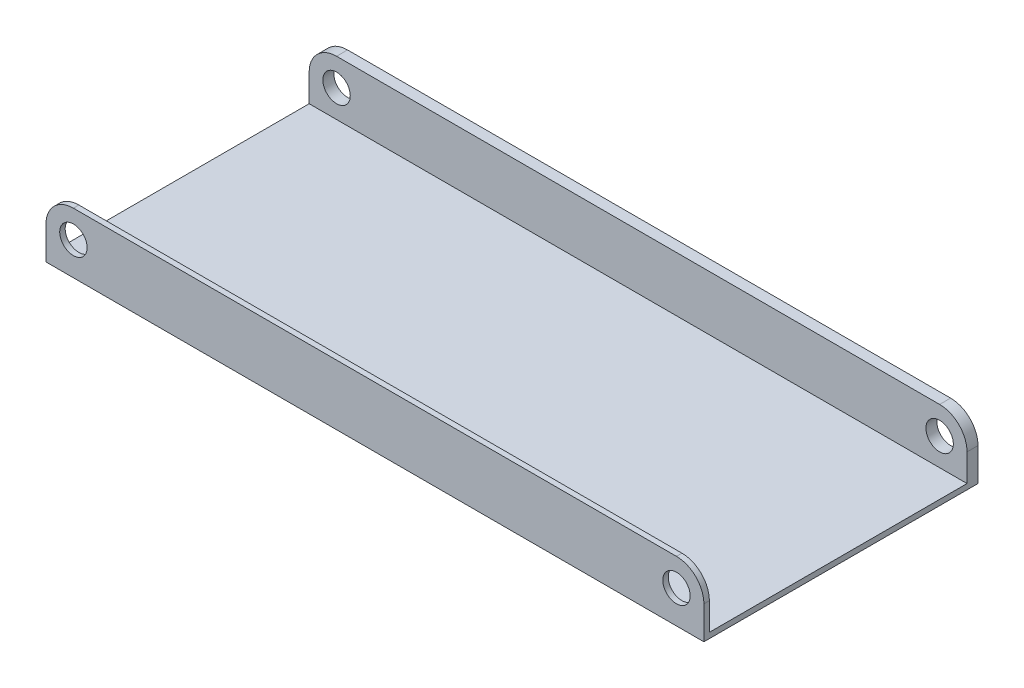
ISO-10303-21;
HEADER;
FILE_DESCRIPTION(('STEP AP214'),'2;1');
FILE_NAME('part.step','',(''),(''),'','','');
FILE_SCHEMA(('AUTOMOTIVE_DESIGN { 1 0 10303 214 1 1 1 1 }'));
ENDSEC;
DATA;
#1=APPLICATION_CONTEXT('core data for automotive mechanical design processes');
#2=APPLICATION_PROTOCOL_DEFINITION('international standard','automotive_design',2000,#1);
#3=PRODUCT_CONTEXT('',#1,'mechanical');
#4=PRODUCT('Part','Part','',(#3));
#5=PRODUCT_RELATED_PRODUCT_CATEGORY('part','',(#4));
#6=PRODUCT_DEFINITION_FORMATION('','',#4);
#7=PRODUCT_DEFINITION_CONTEXT('part definition',#1,'design');
#8=PRODUCT_DEFINITION('design','',#6,#7);
#9=PRODUCT_DEFINITION_SHAPE('','',#8);
#10=(LENGTH_UNIT() NAMED_UNIT(*) SI_UNIT(.MILLI.,.METRE.));
#11=(NAMED_UNIT(*) PLANE_ANGLE_UNIT() SI_UNIT($,.RADIAN.));
#12=(NAMED_UNIT(*) SI_UNIT($,.STERADIAN.) SOLID_ANGLE_UNIT());
#13=UNCERTAINTY_MEASURE_WITH_UNIT(LENGTH_MEASURE(1.E-05),#10,'distance_accuracy_value','');
#14=(GEOMETRIC_REPRESENTATION_CONTEXT(3) GLOBAL_UNCERTAINTY_ASSIGNED_CONTEXT((#13)) GLOBAL_UNIT_ASSIGNED_CONTEXT((#10,
#11,#12)) REPRESENTATION_CONTEXT('',''));
#15=CARTESIAN_POINT('',(0.,0.,0.));
#16=DIRECTION('',(0.,0.,1.));
#17=DIRECTION('',(1.,0.,0.));
#18=AXIS2_PLACEMENT_3D('',#15,#16,#17);
#19=CARTESIAN_POINT('',(0.,1.27,0.));
#20=DIRECTION('',(0.,1.,0.));
#21=DIRECTION('',(0.,0.,1.));
#22=AXIS2_PLACEMENT_3D('',#19,#20,#21);
#23=PLANE('',#22);
#24=DIRECTION('',(0.,0.,-1.));
#25=VECTOR('',#24,1.);
#26=CARTESIAN_POINT('',(152.4,1.27,0.));
#27=LINE('',#26,#25);
#28=CARTESIAN_POINT('',(152.4,1.27,62.23));
#29=VERTEX_POINT('',#28);
#30=CARTESIAN_POINT('',(152.4,1.27,2.53999999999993));
#31=VERTEX_POINT('',#30);
#32=EDGE_CURVE('E139',#29,#31,#27,.T.);
#33=ORIENTED_EDGE('',*,*,#32,.T.);
#34=DIRECTION('',(1.,0.,0.));
#35=VECTOR('',#34,1.);
#36=CARTESIAN_POINT('',(0.,1.27,2.53999999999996));
#37=LINE('',#36,#35);
#38=CARTESIAN_POINT('',(0.,1.27,2.53999999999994));
#39=VERTEX_POINT('',#38);
#40=EDGE_CURVE('E138',#39,#31,#37,.T.);
#41=ORIENTED_EDGE('',*,*,#40,.F.);
#42=DIRECTION('',(0.,0.,1.));
#43=VECTOR('',#42,1.);
#44=CARTESIAN_POINT('',(0.,1.27,0.));
#45=LINE('',#44,#43);
#46=CARTESIAN_POINT('',(0.,1.27,62.23));
#47=VERTEX_POINT('',#46);
#48=EDGE_CURVE('E122',#39,#47,#45,.T.);
#49=ORIENTED_EDGE('',*,*,#48,.T.);
#50=DIRECTION('',(-1.,0.,0.));
#51=VECTOR('',#50,1.);
#52=CARTESIAN_POINT('',(0.,1.27,62.23));
#53=LINE('',#52,#51);
#54=EDGE_CURVE('E135',#29,#47,#53,.T.);
#55=ORIENTED_EDGE('',*,*,#54,.F.);
#56=EDGE_LOOP('',(#33,#41,#49,#55));
#57=FACE_BOUND('',#56,.T.);
#58=ADVANCED_FACE('F33',(#57),#23,.T.);
#59=CARTESIAN_POINT('',(0.,1.27,0.));
#60=DIRECTION('',(1.,0.,0.));
#61=DIRECTION('',(0.,0.,-1.));
#62=AXIS2_PLACEMENT_3D('',#59,#60,#61);
#63=PLANE('',#62);
#64=DIRECTION('',(0.,-1.,0.));
#65=VECTOR('',#64,1.);
#66=CARTESIAN_POINT('',(0.,13.97,2.53999999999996));
#67=LINE('',#66,#65);
#68=CARTESIAN_POINT('',(0.,7.62,2.53999999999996));
#69=VERTEX_POINT('',#68);
#70=EDGE_CURVE('E146',#69,#39,#67,.T.);
#71=ORIENTED_EDGE('',*,*,#70,.F.);
#72=DIRECTION('',(0.,0.,1.));
#73=VECTOR('',#72,1.);
#74=CARTESIAN_POINT('',(0.,7.62,0.));
#75=LINE('',#74,#73);
#76=CARTESIAN_POINT('',(0.,7.62,0.));
#77=VERTEX_POINT('',#76);
#78=EDGE_CURVE('E11',#69,#77,#75,.F.);
#79=ORIENTED_EDGE('',*,*,#78,.T.);
#80=DIRECTION('',(0.,-1.,0.));
#81=VECTOR('',#80,1.);
#82=CARTESIAN_POINT('',(0.,1.27,0.));
#83=LINE('',#82,#81);
#84=CARTESIAN_POINT('',(0.,0.,0.));
#85=VERTEX_POINT('',#84);
#86=EDGE_CURVE('E157',#77,#85,#83,.T.);
#87=ORIENTED_EDGE('',*,*,#86,.T.);
#88=DIRECTION('',(0.,0.,1.));
#89=VECTOR('',#88,1.);
#90=CARTESIAN_POINT('',(0.,0.,0.));
#91=LINE('',#90,#89);
#92=CARTESIAN_POINT('',(0.,0.,63.5));
#93=VERTEX_POINT('',#92);
#94=EDGE_CURVE('E154',#85,#93,#91,.T.);
#95=ORIENTED_EDGE('',*,*,#94,.T.);
#96=DIRECTION('',(0.,-1.,0.));
#97=VECTOR('',#96,1.);
#98=CARTESIAN_POINT('',(0.,1.27,63.5));
#99=LINE('',#98,#97);
#100=CARTESIAN_POINT('',(0.,7.62,63.5));
#101=VERTEX_POINT('',#100);
#102=EDGE_CURVE('E173',#101,#93,#99,.T.);
#103=ORIENTED_EDGE('',*,*,#102,.F.);
#104=DIRECTION('',(0.,0.,1.));
#105=VECTOR('',#104,1.);
#106=CARTESIAN_POINT('',(0.,7.62,0.));
#107=LINE('',#106,#105);
#108=CARTESIAN_POINT('',(0.,7.62,62.23));
#109=VERTEX_POINT('',#108);
#110=EDGE_CURVE('E41',#101,#109,#107,.F.);
#111=ORIENTED_EDGE('',*,*,#110,.T.);
#112=DIRECTION('',(0.,-1.,0.));
#113=VECTOR('',#112,1.);
#114=CARTESIAN_POINT('',(0.,13.97,62.23));
#115=LINE('',#114,#113);
#116=EDGE_CURVE('E119',#109,#47,#115,.T.);
#117=ORIENTED_EDGE('',*,*,#116,.T.);
#118=ORIENTED_EDGE('',*,*,#48,.F.);
#119=EDGE_LOOP('',(#71,#79,#87,#95,#103,#111,#117,#118));
#120=FACE_BOUND('',#119,.T.);
#121=ADVANCED_FACE('F121',(#120),#63,.F.);
#122=CARTESIAN_POINT('',(0.,1.27,63.5));
#123=DIRECTION('',(0.,0.,-1.));
#124=DIRECTION('',(-1.,0.,0.));
#125=AXIS2_PLACEMENT_3D('',#122,#123,#124);
#126=PLANE('',#125);
#127=CARTESIAN_POINT('',(6.35,7.62,63.5));
#128=DIRECTION('',(0.,0.,1.));
#129=DIRECTION('',(1.,0.,0.));
#130=AXIS2_PLACEMENT_3D('',#127,#128,#129);
#131=CIRCLE('',#130,3.175);
#132=CARTESIAN_POINT('',(9.525,7.62,63.5));
#133=VERTEX_POINT('',#132);
#134=EDGE_CURVE('E306',#133,#133,#131,.T.);
#135=ORIENTED_EDGE('',*,*,#134,.F.);
#136=EDGE_LOOP('',(#135));
#137=FACE_BOUND('',#136,.T.);
#138=CARTESIAN_POINT('',(146.05,7.62,63.5));
#139=DIRECTION('',(0.,0.,1.));
#140=DIRECTION('',(1.,0.,0.));
#141=AXIS2_PLACEMENT_3D('',#138,#139,#140);
#142=CIRCLE('',#141,3.175);
#143=CARTESIAN_POINT('',(149.225,7.62,63.5));
#144=VERTEX_POINT('',#143);
#145=EDGE_CURVE('E300',#144,#144,#142,.T.);
#146=ORIENTED_EDGE('',*,*,#145,.F.);
#147=EDGE_LOOP('',(#146));
#148=FACE_BOUND('',#147,.T.);
#149=DIRECTION('',(0.,-1.,0.));
#150=VECTOR('',#149,1.);
#151=CARTESIAN_POINT('',(152.4,1.27,63.5));
#152=LINE('',#151,#150);
#153=CARTESIAN_POINT('',(152.4,7.62,63.5));
#154=VERTEX_POINT('',#153);
#155=CARTESIAN_POINT('',(152.4,0.,63.5));
#156=VERTEX_POINT('',#155);
#157=EDGE_CURVE('E171',#154,#156,#152,.T.);
#158=ORIENTED_EDGE('',*,*,#157,.F.);
#159=CARTESIAN_POINT('',(146.05,7.62,63.5));
#160=DIRECTION('',(0.,0.,-1.));
#161=DIRECTION('',(-1.,0.,0.));
#162=AXIS2_PLACEMENT_3D('',#159,#160,#161);
#163=CIRCLE('',#162,6.35);
#164=CARTESIAN_POINT('',(146.05,13.97,63.5));
#165=VERTEX_POINT('',#164);
#166=EDGE_CURVE('E200',#154,#165,#163,.F.);
#167=ORIENTED_EDGE('',*,*,#166,.T.);
#168=DIRECTION('',(1.,0.,0.));
#169=VECTOR('',#168,1.);
#170=CARTESIAN_POINT('',(0.,13.97,63.5));
#171=LINE('',#170,#169);
#172=CARTESIAN_POINT('',(6.35000000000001,13.97,63.5));
#173=VERTEX_POINT('',#172);
#174=EDGE_CURVE('E145',#173,#165,#171,.T.);
#175=ORIENTED_EDGE('',*,*,#174,.F.);
#176=CARTESIAN_POINT('',(6.35000000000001,7.62,63.5));
#177=DIRECTION('',(0.,0.,-1.));
#178=DIRECTION('',(-1.,0.,0.));
#179=AXIS2_PLACEMENT_3D('',#176,#177,#178);
#180=CIRCLE('',#179,6.35);
#181=EDGE_CURVE('E198',#173,#101,#180,.F.);
#182=ORIENTED_EDGE('',*,*,#181,.T.);
#183=ORIENTED_EDGE('',*,*,#102,.T.);
#184=DIRECTION('',(1.,0.,0.));
#185=VECTOR('',#184,1.);
#186=CARTESIAN_POINT('',(0.,0.,63.5));
#187=LINE('',#186,#185);
#188=EDGE_CURVE('E160',#93,#156,#187,.T.);
#189=ORIENTED_EDGE('',*,*,#188,.T.);
#190=EDGE_LOOP('',(#158,#167,#175,#182,#183,#189));
#191=FACE_BOUND('',#190,.T.);
#192=ADVANCED_FACE('F258',(#137,#148,#191),#126,.F.);
#193=CARTESIAN_POINT('',(152.4,1.27,0.));
#194=DIRECTION('',(-1.,0.,0.));
#195=DIRECTION('',(0.,0.,1.));
#196=AXIS2_PLACEMENT_3D('',#193,#194,#195);
#197=PLANE('',#196);
#198=DIRECTION('',(0.,-1.,0.));
#199=VECTOR('',#198,1.);
#200=CARTESIAN_POINT('',(152.4,13.97,62.23));
#201=LINE('',#200,#199);
#202=CARTESIAN_POINT('',(152.4,7.62,62.23));
#203=VERTEX_POINT('',#202);
#204=EDGE_CURVE('E128',#203,#29,#201,.T.);
#205=ORIENTED_EDGE('',*,*,#204,.F.);
#206=DIRECTION('',(0.,0.,-1.));
#207=VECTOR('',#206,1.);
#208=CARTESIAN_POINT('',(152.4,7.62,0.));
#209=LINE('',#208,#207);
#210=EDGE_CURVE('E196',#203,#154,#209,.F.);
#211=ORIENTED_EDGE('',*,*,#210,.T.);
#212=ORIENTED_EDGE('',*,*,#157,.T.);
#213=DIRECTION('',(0.,0.,-1.));
#214=VECTOR('',#213,1.);
#215=CARTESIAN_POINT('',(152.4,0.,0.));
#216=LINE('',#215,#214);
#217=CARTESIAN_POINT('',(152.4,0.,0.));
#218=VERTEX_POINT('',#217);
#219=EDGE_CURVE('E163',#156,#218,#216,.T.);
#220=ORIENTED_EDGE('',*,*,#219,.T.);
#221=DIRECTION('',(0.,-1.,0.));
#222=VECTOR('',#221,1.);
#223=CARTESIAN_POINT('',(152.4,1.27,0.));
#224=LINE('',#223,#222);
#225=CARTESIAN_POINT('',(152.4,7.62,0.));
#226=VERTEX_POINT('',#225);
#227=EDGE_CURVE('E169',#226,#218,#224,.T.);
#228=ORIENTED_EDGE('',*,*,#227,.F.);
#229=DIRECTION('',(0.,0.,-1.));
#230=VECTOR('',#229,1.);
#231=CARTESIAN_POINT('',(152.4,7.62,2.53999999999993));
#232=LINE('',#231,#230);
#233=CARTESIAN_POINT('',(152.4,7.62,2.53999999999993));
#234=VERTEX_POINT('',#233);
#235=EDGE_CURVE('E194',#226,#234,#232,.F.);
#236=ORIENTED_EDGE('',*,*,#235,.T.);
#237=DIRECTION('',(0.,-1.,0.));
#238=VECTOR('',#237,1.);
#239=CARTESIAN_POINT('',(152.4,13.97,2.53999999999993));
#240=LINE('',#239,#238);
#241=EDGE_CURVE('E150',#234,#31,#240,.T.);
#242=ORIENTED_EDGE('',*,*,#241,.T.);
#243=ORIENTED_EDGE('',*,*,#32,.F.);
#244=EDGE_LOOP('',(#205,#211,#212,#220,#228,#236,#242,#243));
#245=FACE_BOUND('',#244,.T.);
#246=ADVANCED_FACE('F234',(#245),#197,.F.);
#247=CARTESIAN_POINT('',(0.,1.27,0.));
#248=DIRECTION('',(0.,0.,1.));
#249=DIRECTION('',(1.,0.,0.));
#250=AXIS2_PLACEMENT_3D('',#247,#248,#249);
#251=PLANE('',#250);
#252=CARTESIAN_POINT('',(6.35,7.62,0.));
#253=DIRECTION('',(0.,0.,1.));
#254=DIRECTION('',(1.,0.,0.));
#255=AXIS2_PLACEMENT_3D('',#252,#253,#254);
#256=CIRCLE('',#255,3.175);
#257=CARTESIAN_POINT('',(9.525,7.62,0.));
#258=VERTEX_POINT('',#257);
#259=EDGE_CURVE('E180',#258,#258,#256,.T.);
#260=ORIENTED_EDGE('',*,*,#259,.T.);
#261=EDGE_LOOP('',(#260));
#262=FACE_BOUND('',#261,.T.);
#263=CARTESIAN_POINT('',(146.05,7.62,0.));
#264=DIRECTION('',(0.,0.,1.));
#265=DIRECTION('',(1.,0.,0.));
#266=AXIS2_PLACEMENT_3D('',#263,#264,#265);
#267=CIRCLE('',#266,3.175);
#268=CARTESIAN_POINT('',(149.225,7.62,0.));
#269=VERTEX_POINT('',#268);
#270=EDGE_CURVE('E303',#269,#269,#267,.T.);
#271=ORIENTED_EDGE('',*,*,#270,.T.);
#272=EDGE_LOOP('',(#271));
#273=FACE_BOUND('',#272,.T.);
#274=DIRECTION('',(-1.,0.,0.));
#275=VECTOR('',#274,1.);
#276=CARTESIAN_POINT('',(0.,13.97,0.));
#277=LINE('',#276,#275);
#278=CARTESIAN_POINT('',(146.05,13.97,0.));
#279=VERTEX_POINT('',#278);
#280=CARTESIAN_POINT('',(6.35,13.97,0.));
#281=VERTEX_POINT('',#280);
#282=EDGE_CURVE('E227',#279,#281,#277,.T.);
#283=ORIENTED_EDGE('',*,*,#282,.F.);
#284=CARTESIAN_POINT('',(146.05,7.62,0.));
#285=DIRECTION('',(0.,0.,1.));
#286=DIRECTION('',(1.,0.,0.));
#287=AXIS2_PLACEMENT_3D('',#284,#285,#286);
#288=CIRCLE('',#287,6.35);
#289=EDGE_CURVE('E210',#279,#226,#288,.F.);
#290=ORIENTED_EDGE('',*,*,#289,.T.);
#291=ORIENTED_EDGE('',*,*,#227,.T.);
#292=DIRECTION('',(-1.,0.,0.));
#293=VECTOR('',#292,1.);
#294=CARTESIAN_POINT('',(0.,0.,0.));
#295=LINE('',#294,#293);
#296=EDGE_CURVE('E140',#218,#85,#295,.T.);
#297=ORIENTED_EDGE('',*,*,#296,.T.);
#298=ORIENTED_EDGE('',*,*,#86,.F.);
#299=CARTESIAN_POINT('',(6.35,7.62,0.));
#300=DIRECTION('',(0.,0.,1.));
#301=DIRECTION('',(1.,0.,0.));
#302=AXIS2_PLACEMENT_3D('',#299,#300,#301);
#303=CIRCLE('',#302,6.35);
#304=EDGE_CURVE('E208',#77,#281,#303,.F.);
#305=ORIENTED_EDGE('',*,*,#304,.T.);
#306=EDGE_LOOP('',(#283,#290,#291,#297,#298,#305));
#307=FACE_BOUND('',#306,.T.);
#308=ADVANCED_FACE('F232',(#262,#273,#307),#251,.F.);
#309=CARTESIAN_POINT('',(0.,0.,0.));
#310=DIRECTION('',(0.,1.,0.));
#311=DIRECTION('',(0.,0.,1.));
#312=AXIS2_PLACEMENT_3D('',#309,#310,#311);
#313=PLANE('',#312);
#314=ORIENTED_EDGE('',*,*,#94,.F.);
#315=ORIENTED_EDGE('',*,*,#296,.F.);
#316=ORIENTED_EDGE('',*,*,#219,.F.);
#317=ORIENTED_EDGE('',*,*,#188,.F.);
#318=EDGE_LOOP('',(#314,#315,#316,#317));
#319=FACE_BOUND('',#318,.T.);
#320=ADVANCED_FACE('F241',(#319),#313,.F.);
#321=CARTESIAN_POINT('',(0.,13.97,62.23));
#322=DIRECTION('',(0.,0.,1.));
#323=DIRECTION('',(1.,0.,0.));
#324=AXIS2_PLACEMENT_3D('',#321,#322,#323);
#325=PLANE('',#324);
#326=CARTESIAN_POINT('',(6.35,7.62,62.23));
#327=DIRECTION('',(0.,0.,1.));
#328=DIRECTION('',(1.,0.,0.));
#329=AXIS2_PLACEMENT_3D('',#326,#327,#328);
#330=CIRCLE('',#329,3.175);
#331=CARTESIAN_POINT('',(9.525,7.62,62.23));
#332=VERTEX_POINT('',#331);
#333=EDGE_CURVE('E184',#332,#332,#330,.T.);
#334=ORIENTED_EDGE('',*,*,#333,.T.);
#335=EDGE_LOOP('',(#334));
#336=FACE_BOUND('',#335,.T.);
#337=CARTESIAN_POINT('',(146.05,7.62,62.23));
#338=DIRECTION('',(0.,0.,1.));
#339=DIRECTION('',(1.,0.,0.));
#340=AXIS2_PLACEMENT_3D('',#337,#338,#339);
#341=CIRCLE('',#340,3.175);
#342=CARTESIAN_POINT('',(149.225,7.62,62.23));
#343=VERTEX_POINT('',#342);
#344=EDGE_CURVE('E179',#343,#343,#341,.T.);
#345=ORIENTED_EDGE('',*,*,#344,.T.);
#346=EDGE_LOOP('',(#345));
#347=FACE_BOUND('',#346,.T.);
#348=DIRECTION('',(-1.,0.,0.));
#349=VECTOR('',#348,1.);
#350=CARTESIAN_POINT('',(0.,13.97,62.23));
#351=LINE('',#350,#349);
#352=CARTESIAN_POINT('',(146.05,13.97,62.23));
#353=VERTEX_POINT('',#352);
#354=CARTESIAN_POINT('',(6.35000000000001,13.97,62.23));
#355=VERTEX_POINT('',#354);
#356=EDGE_CURVE('E129',#353,#355,#351,.T.);
#357=ORIENTED_EDGE('',*,*,#356,.F.);
#358=CARTESIAN_POINT('',(146.05,7.62,62.23));
#359=DIRECTION('',(0.,0.,1.));
#360=DIRECTION('',(1.,0.,0.));
#361=AXIS2_PLACEMENT_3D('',#358,#359,#360);
#362=CIRCLE('',#361,6.35);
#363=EDGE_CURVE('E192',#353,#203,#362,.F.);
#364=ORIENTED_EDGE('',*,*,#363,.T.);
#365=ORIENTED_EDGE('',*,*,#204,.T.);
#366=ORIENTED_EDGE('',*,*,#54,.T.);
#367=ORIENTED_EDGE('',*,*,#116,.F.);
#368=CARTESIAN_POINT('',(6.35000000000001,7.62,62.23));
#369=DIRECTION('',(0.,0.,1.));
#370=DIRECTION('',(1.,0.,0.));
#371=AXIS2_PLACEMENT_3D('',#368,#369,#370);
#372=CIRCLE('',#371,6.35);
#373=EDGE_CURVE('E190',#109,#355,#372,.F.);
#374=ORIENTED_EDGE('',*,*,#373,.T.);
#375=EDGE_LOOP('',(#357,#364,#365,#366,#367,#374));
#376=FACE_BOUND('',#375,.T.);
#377=ADVANCED_FACE('F143',(#336,#347,#376),#325,.F.);
#378=CARTESIAN_POINT('',(0.,13.97,0.));
#379=DIRECTION('',(0.,-1.,0.));
#380=DIRECTION('',(0.,0.,-1.));
#381=AXIS2_PLACEMENT_3D('',#378,#379,#380);
#382=PLANE('',#381);
#383=ORIENTED_EDGE('',*,*,#174,.T.);
#384=DIRECTION('',(0.,0.,-1.));
#385=VECTOR('',#384,1.);
#386=CARTESIAN_POINT('',(146.05,13.97,0.));
#387=LINE('',#386,#385);
#388=EDGE_CURVE('E187',#165,#353,#387,.T.);
#389=ORIENTED_EDGE('',*,*,#388,.T.);
#390=ORIENTED_EDGE('',*,*,#356,.T.);
#391=DIRECTION('',(0.,0.,1.));
#392=VECTOR('',#391,1.);
#393=CARTESIAN_POINT('',(6.35,13.97,0.));
#394=LINE('',#393,#392);
#395=EDGE_CURVE('E175',#355,#173,#394,.T.);
#396=ORIENTED_EDGE('',*,*,#395,.T.);
#397=EDGE_LOOP('',(#383,#389,#390,#396));
#398=FACE_BOUND('',#397,.T.);
#399=ADVANCED_FACE('F289',(#398),#382,.F.);
#400=CARTESIAN_POINT('',(0.,13.97,2.53999999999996));
#401=DIRECTION('',(0.,0.,-1.));
#402=DIRECTION('',(-1.,0.,0.));
#403=AXIS2_PLACEMENT_3D('',#400,#401,#402);
#404=PLANE('',#403);
#405=CARTESIAN_POINT('',(6.35,7.62,2.53999999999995));
#406=DIRECTION('',(0.,0.,-1.));
#407=DIRECTION('',(-1.,0.,0.));
#408=AXIS2_PLACEMENT_3D('',#405,#406,#407);
#409=CIRCLE('',#408,3.175);
#410=CARTESIAN_POINT('',(3.175,7.62,2.53999999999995));
#411=VERTEX_POINT('',#410);
#412=EDGE_CURVE('E181',#411,#411,#409,.T.);
#413=ORIENTED_EDGE('',*,*,#412,.T.);
#414=EDGE_LOOP('',(#413));
#415=FACE_BOUND('',#414,.T.);
#416=CARTESIAN_POINT('',(146.05,7.62,2.53999999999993));
#417=DIRECTION('',(0.,0.,-1.));
#418=DIRECTION('',(-1.,0.,0.));
#419=AXIS2_PLACEMENT_3D('',#416,#417,#418);
#420=CIRCLE('',#419,3.175);
#421=CARTESIAN_POINT('',(142.875,7.62,2.53999999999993));
#422=VERTEX_POINT('',#421);
#423=EDGE_CURVE('E176',#422,#422,#420,.T.);
#424=ORIENTED_EDGE('',*,*,#423,.T.);
#425=EDGE_LOOP('',(#424));
#426=FACE_BOUND('',#425,.T.);
#427=ORIENTED_EDGE('',*,*,#241,.F.);
#428=CARTESIAN_POINT('',(146.05,7.62,2.53999999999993));
#429=DIRECTION('',(0.,0.,-1.));
#430=DIRECTION('',(-1.,0.,0.));
#431=AXIS2_PLACEMENT_3D('',#428,#429,#430);
#432=CIRCLE('',#431,6.35);
#433=CARTESIAN_POINT('',(146.05,13.97,2.53999999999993));
#434=VERTEX_POINT('',#433);
#435=EDGE_CURVE('E213',#234,#434,#432,.F.);
#436=ORIENTED_EDGE('',*,*,#435,.T.);
#437=DIRECTION('',(1.,0.,0.));
#438=VECTOR('',#437,1.);
#439=CARTESIAN_POINT('',(0.,13.97,2.53999999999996));
#440=LINE('',#439,#438);
#441=CARTESIAN_POINT('',(6.35,13.97,2.53999999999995));
#442=VERTEX_POINT('',#441);
#443=EDGE_CURVE('E218',#442,#434,#440,.T.);
#444=ORIENTED_EDGE('',*,*,#443,.F.);
#445=CARTESIAN_POINT('',(6.35,7.62,2.53999999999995));
#446=DIRECTION('',(0.,0.,-1.));
#447=DIRECTION('',(-1.,0.,0.));
#448=AXIS2_PLACEMENT_3D('',#445,#446,#447);
#449=CIRCLE('',#448,6.35);
#450=EDGE_CURVE('E48',#442,#69,#449,.F.);
#451=ORIENTED_EDGE('',*,*,#450,.T.);
#452=ORIENTED_EDGE('',*,*,#70,.T.);
#453=ORIENTED_EDGE('',*,*,#40,.T.);
#454=EDGE_LOOP('',(#427,#436,#444,#451,#452,#453));
#455=FACE_BOUND('',#454,.T.);
#456=ADVANCED_FACE('F217',(#415,#426,#455),#404,.F.);
#457=CARTESIAN_POINT('',(0.,13.97,0.));
#458=DIRECTION('',(0.,1.,0.));
#459=DIRECTION('',(0.,0.,1.));
#460=AXIS2_PLACEMENT_3D('',#457,#458,#459);
#461=PLANE('',#460);
#462=ORIENTED_EDGE('',*,*,#443,.T.);
#463=DIRECTION('',(0.,0.,-1.));
#464=VECTOR('',#463,1.);
#465=CARTESIAN_POINT('',(146.05,13.97,0.));
#466=LINE('',#465,#464);
#467=EDGE_CURVE('E205',#434,#279,#466,.T.);
#468=ORIENTED_EDGE('',*,*,#467,.T.);
#469=ORIENTED_EDGE('',*,*,#282,.T.);
#470=DIRECTION('',(0.,0.,1.));
#471=VECTOR('',#470,1.);
#472=CARTESIAN_POINT('',(6.35,13.97,2.53999999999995));
#473=LINE('',#472,#471);
#474=EDGE_CURVE('E202',#281,#442,#473,.T.);
#475=ORIENTED_EDGE('',*,*,#474,.T.);
#476=EDGE_LOOP('',(#462,#468,#469,#475));
#477=FACE_BOUND('',#476,.T.);
#478=ADVANCED_FACE('F223',(#477),#461,.T.);
#479=CARTESIAN_POINT('',(146.05,7.62,0.));
#480=DIRECTION('',(0.,0.,1.));
#481=DIRECTION('',(1.,0.,0.));
#482=AXIS2_PLACEMENT_3D('',#479,#480,#481);
#483=CYLINDRICAL_SURFACE('',#482,3.175);
#484=ORIENTED_EDGE('',*,*,#270,.F.);
#485=EDGE_LOOP('',(#484));
#486=FACE_BOUND('',#485,.T.);
#487=ORIENTED_EDGE('',*,*,#423,.F.);
#488=EDGE_LOOP('',(#487));
#489=FACE_BOUND('',#488,.T.);
#490=ADVANCED_FACE('F315',(#486,#489),#483,.F.);
#491=CARTESIAN_POINT('',(6.35,7.62,0.));
#492=DIRECTION('',(0.,0.,1.));
#493=DIRECTION('',(1.,0.,0.));
#494=AXIS2_PLACEMENT_3D('',#491,#492,#493);
#495=CYLINDRICAL_SURFACE('',#494,3.175);
#496=ORIENTED_EDGE('',*,*,#259,.F.);
#497=EDGE_LOOP('',(#496));
#498=FACE_BOUND('',#497,.T.);
#499=ORIENTED_EDGE('',*,*,#412,.F.);
#500=EDGE_LOOP('',(#499));
#501=FACE_BOUND('',#500,.T.);
#502=ADVANCED_FACE('F282',(#498,#501),#495,.F.);
#503=ORIENTED_EDGE('',*,*,#145,.T.);
#504=EDGE_LOOP('',(#503));
#505=FACE_BOUND('',#504,.T.);
#506=ORIENTED_EDGE('',*,*,#344,.F.);
#507=EDGE_LOOP('',(#506));
#508=FACE_BOUND('',#507,.T.);
#509=ADVANCED_FACE('F279',(#505,#508),#483,.F.);
#510=ORIENTED_EDGE('',*,*,#134,.T.);
#511=EDGE_LOOP('',(#510));
#512=FACE_BOUND('',#511,.T.);
#513=ORIENTED_EDGE('',*,*,#333,.F.);
#514=EDGE_LOOP('',(#513));
#515=FACE_BOUND('',#514,.T.);
#516=ADVANCED_FACE('F274',(#512,#515),#495,.F.);
#517=CARTESIAN_POINT('',(146.05,7.62,0.));
#518=DIRECTION('',(0.,0.,-1.));
#519=DIRECTION('',(-1.,0.,0.));
#520=AXIS2_PLACEMENT_3D('',#517,#518,#519);
#521=CYLINDRICAL_SURFACE('',#520,6.35);
#522=ORIENTED_EDGE('',*,*,#166,.F.);
#523=ORIENTED_EDGE('',*,*,#210,.F.);
#524=ORIENTED_EDGE('',*,*,#363,.F.);
#525=ORIENTED_EDGE('',*,*,#388,.F.);
#526=EDGE_LOOP('',(#522,#523,#524,#525));
#527=FACE_BOUND('',#526,.T.);
#528=ADVANCED_FACE('F251',(#527),#521,.T.);
#529=CARTESIAN_POINT('',(146.05,7.62,0.));
#530=DIRECTION('',(0.,0.,1.));
#531=DIRECTION('',(1.,0.,0.));
#532=AXIS2_PLACEMENT_3D('',#529,#530,#531);
#533=CYLINDRICAL_SURFACE('',#532,6.35);
#534=ORIENTED_EDGE('',*,*,#435,.F.);
#535=ORIENTED_EDGE('',*,*,#235,.F.);
#536=ORIENTED_EDGE('',*,*,#289,.F.);
#537=ORIENTED_EDGE('',*,*,#467,.F.);
#538=EDGE_LOOP('',(#534,#535,#536,#537));
#539=FACE_BOUND('',#538,.T.);
#540=ADVANCED_FACE('F229',(#539),#533,.T.);
#541=CARTESIAN_POINT('',(6.35,7.62,0.));
#542=DIRECTION('',(0.,0.,-1.));
#543=DIRECTION('',(-1.,0.,0.));
#544=AXIS2_PLACEMENT_3D('',#541,#542,#543);
#545=CYLINDRICAL_SURFACE('',#544,6.35);
#546=ORIENTED_EDGE('',*,*,#304,.F.);
#547=ORIENTED_EDGE('',*,*,#78,.F.);
#548=ORIENTED_EDGE('',*,*,#450,.F.);
#549=ORIENTED_EDGE('',*,*,#474,.F.);
#550=EDGE_LOOP('',(#546,#547,#548,#549));
#551=FACE_BOUND('',#550,.T.);
#552=ADVANCED_FACE('F244',(#551),#545,.T.);
#553=CARTESIAN_POINT('',(6.35,7.62,0.));
#554=DIRECTION('',(0.,0.,1.));
#555=DIRECTION('',(1.,0.,0.));
#556=AXIS2_PLACEMENT_3D('',#553,#554,#555);
#557=CYLINDRICAL_SURFACE('',#556,6.35);
#558=ORIENTED_EDGE('',*,*,#373,.F.);
#559=ORIENTED_EDGE('',*,*,#110,.F.);
#560=ORIENTED_EDGE('',*,*,#181,.F.);
#561=ORIENTED_EDGE('',*,*,#395,.F.);
#562=EDGE_LOOP('',(#558,#559,#560,#561));
#563=FACE_BOUND('',#562,.T.);
#564=ADVANCED_FACE('F35',(#563),#557,.T.);
#565=CLOSED_SHELL('',(#58,#121,#192,#246,#308,#320,#377,#399,#456,#478,#490,#502,#509,#516,#528,
#540,#552,#564));
#566=MANIFOLD_SOLID_BREP('B2',#565);
#567=ADVANCED_BREP_SHAPE_REPRESENTATION('',(#18,#566),#14);
#568=SHAPE_DEFINITION_REPRESENTATION(#9,#567);
ENDSEC;
END-ISO-10303-21;
